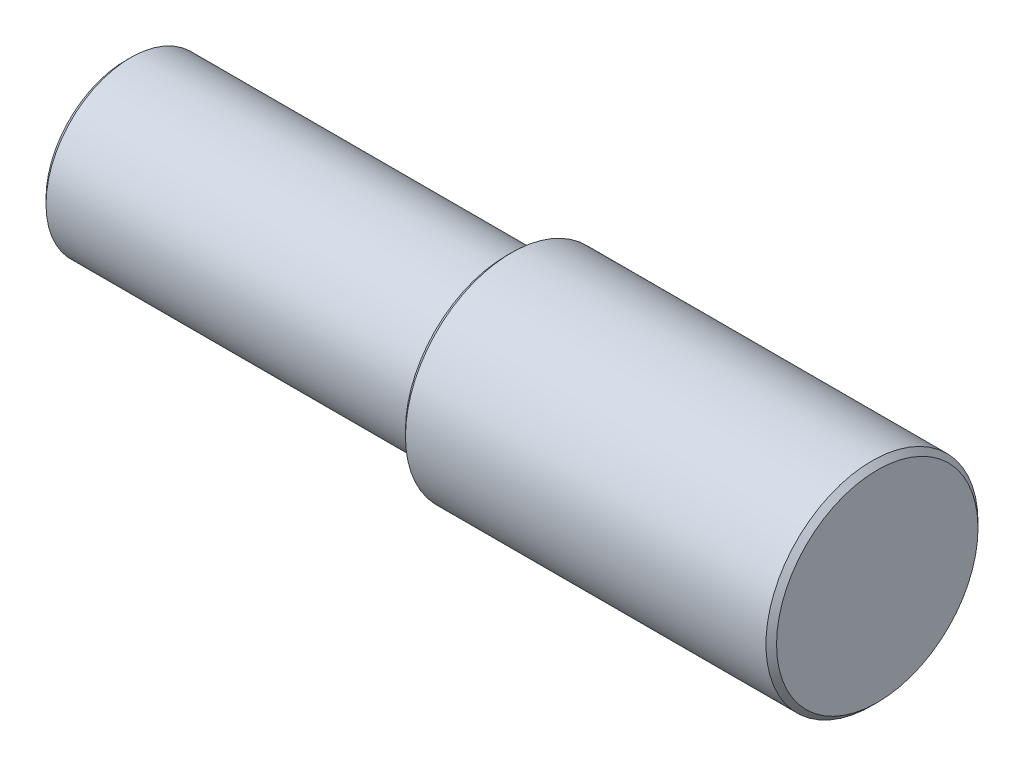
ISO-10303-21;
HEADER;
FILE_DESCRIPTION(('STEP AP214'),'2;1');
FILE_NAME('part.step','',(''),(''),'','','');
FILE_SCHEMA(('AUTOMOTIVE_DESIGN { 1 0 10303 214 1 1 1 1 }'));
ENDSEC;
DATA;
#1=APPLICATION_CONTEXT('core data for automotive mechanical design processes');
#2=APPLICATION_PROTOCOL_DEFINITION('international standard','automotive_design',2000,#1);
#3=PRODUCT_CONTEXT('',#1,'mechanical');
#4=PRODUCT('Part','Part','',(#3));
#5=PRODUCT_RELATED_PRODUCT_CATEGORY('part','',(#4));
#6=PRODUCT_DEFINITION_FORMATION('','',#4);
#7=PRODUCT_DEFINITION_CONTEXT('part definition',#1,'design');
#8=PRODUCT_DEFINITION('design','',#6,#7);
#9=PRODUCT_DEFINITION_SHAPE('','',#8);
#10=(LENGTH_UNIT() NAMED_UNIT(*) SI_UNIT(.MILLI.,.METRE.));
#11=(NAMED_UNIT(*) PLANE_ANGLE_UNIT() SI_UNIT($,.RADIAN.));
#12=(NAMED_UNIT(*) SI_UNIT($,.STERADIAN.) SOLID_ANGLE_UNIT());
#13=UNCERTAINTY_MEASURE_WITH_UNIT(LENGTH_MEASURE(1.E-05),#10,'distance_accuracy_value','');
#14=(GEOMETRIC_REPRESENTATION_CONTEXT(3) GLOBAL_UNCERTAINTY_ASSIGNED_CONTEXT((#13)) GLOBAL_UNIT_ASSIGNED_CONTEXT((#10,
#11,#12)) REPRESENTATION_CONTEXT('',''));
#15=CARTESIAN_POINT('',(0.,0.,0.));
#16=DIRECTION('',(0.,0.,1.));
#17=DIRECTION('',(1.,0.,0.));
#18=AXIS2_PLACEMENT_3D('',#15,#16,#17);
#19=CARTESIAN_POINT('',(-35.,0.,0.));
#20=DIRECTION('',(1.,0.,0.));
#21=DIRECTION('',(0.,0.,-1.));
#22=AXIS2_PLACEMENT_3D('',#19,#20,#21);
#23=CYLINDRICAL_SURFACE('',#22,10.);
#24=CARTESIAN_POINT('',(-0.500000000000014,0.,0.));
#25=DIRECTION('',(1.,0.,0.));
#26=DIRECTION('',(0.,0.,-1.));
#27=AXIS2_PLACEMENT_3D('',#24,#25,#26);
#28=CIRCLE('',#27,10.);
#29=CARTESIAN_POINT('',(-0.500000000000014,0.,-10.));
#30=VERTEX_POINT('',#29);
#31=EDGE_CURVE('E123',#30,#30,#28,.F.);
#32=ORIENTED_EDGE('',*,*,#31,.T.);
#33=EDGE_LOOP('',(#32));
#34=FACE_BOUND('',#33,.T.);
#35=CARTESIAN_POINT('',(-34.5,0.,0.));
#36=DIRECTION('',(-1.,0.,0.));
#37=DIRECTION('',(0.,0.,1.));
#38=AXIS2_PLACEMENT_3D('',#35,#36,#37);
#39=CIRCLE('',#38,10.);
#40=CARTESIAN_POINT('',(-34.5,0.,10.));
#41=VERTEX_POINT('',#40);
#42=EDGE_CURVE('E120',#41,#41,#39,.F.);
#43=ORIENTED_EDGE('',*,*,#42,.T.);
#44=EDGE_LOOP('',(#43));
#45=FACE_BOUND('',#44,.T.);
#46=ADVANCED_FACE('F35',(#34,#45),#23,.T.);
#47=CARTESIAN_POINT('',(-35.,10.,0.));
#48=DIRECTION('',(-1.,0.,0.));
#49=DIRECTION('',(0.,0.,1.));
#50=AXIS2_PLACEMENT_3D('',#47,#48,#49);
#51=PLANE('',#50);
#52=CARTESIAN_POINT('',(-35.,0.,0.));
#53=DIRECTION('',(-1.,0.,0.));
#54=DIRECTION('',(0.,0.,1.));
#55=AXIS2_PLACEMENT_3D('',#52,#53,#54);
#56=CIRCLE('',#55,9.49999999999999);
#57=CARTESIAN_POINT('',(-35.,0.,9.49999999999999));
#58=VERTEX_POINT('',#57);
#59=EDGE_CURVE('E126',#58,#58,#56,.T.);
#60=ORIENTED_EDGE('',*,*,#59,.T.);
#61=EDGE_LOOP('',(#60));
#62=FACE_BOUND('',#61,.T.);
#63=CARTESIAN_POINT('',(-35.,0.,0.));
#64=DIRECTION('',(-1.,0.,0.));
#65=DIRECTION('',(0.,0.,1.));
#66=AXIS2_PLACEMENT_3D('',#63,#64,#65);
#67=CIRCLE('',#66,7.99999999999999);
#68=CARTESIAN_POINT('',(-35.,0.,7.99999999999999));
#69=VERTEX_POINT('',#68);
#70=EDGE_CURVE('E114',#69,#69,#67,.T.);
#71=ORIENTED_EDGE('',*,*,#70,.F.);
#72=EDGE_LOOP('',(#71));
#73=FACE_BOUND('',#72,.T.);
#74=ADVANCED_FACE('F182',(#62,#73),#51,.T.);
#75=CARTESIAN_POINT('',(0.,0.,0.));
#76=DIRECTION('',(1.,0.,0.));
#77=DIRECTION('',(0.,0.,-1.));
#78=AXIS2_PLACEMENT_3D('',#75,#76,#77);
#79=PLANE('',#78);
#80=CARTESIAN_POINT('',(0.,0.,0.));
#81=DIRECTION('',(1.,0.,0.));
#82=DIRECTION('',(0.,0.,-1.));
#83=AXIS2_PLACEMENT_3D('',#80,#81,#82);
#84=CIRCLE('',#83,9.49999999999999);
#85=CARTESIAN_POINT('',(0.,0.,-9.49999999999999));
#86=VERTEX_POINT('',#85);
#87=EDGE_CURVE('E117',#86,#86,#84,.T.);
#88=ORIENTED_EDGE('',*,*,#87,.T.);
#89=EDGE_LOOP('',(#88));
#90=FACE_BOUND('',#89,.T.);
#91=ADVANCED_FACE('F178',(#90),#79,.T.);
#92=CARTESIAN_POINT('',(-70.9,0.,0.));
#93=DIRECTION('',(1.,0.,0.));
#94=DIRECTION('',(0.,0.,-1.));
#95=AXIS2_PLACEMENT_3D('',#92,#93,#94);
#96=CYLINDRICAL_SURFACE('',#95,7.99999999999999);
#97=DIRECTION('',(1.,0.,0.));
#98=VECTOR('',#97,1.);
#99=CARTESIAN_POINT('',(-70.9,-2.5,-7.59934207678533));
#100=LINE('',#99,#98);
#101=CARTESIAN_POINT('',(-65.45,-2.5,-7.59934207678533));
#102=VERTEX_POINT('',#101);
#103=CARTESIAN_POINT('',(-40.45,-2.5,-7.59934207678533));
#104=VERTEX_POINT('',#103);
#105=EDGE_CURVE('E49',#102,#104,#100,.T.);
#106=ORIENTED_EDGE('',*,*,#105,.T.);
#107=CARTESIAN_POINT('',(-40.45,-2.5,-7.59934207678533));
#108=CARTESIAN_POINT('',(-40.3815339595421,-2.5000087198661,-7.59933203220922));
#109=CARTESIAN_POINT('',(-40.3130736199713,-2.4971876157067,-7.60026710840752));
#110=CARTESIAN_POINT('',(-40.1766785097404,-2.48595363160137,-7.60395280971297));
#111=CARTESIAN_POINT('',(-40.1087436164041,-2.47754209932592,-7.60670299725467));
#112=CARTESIAN_POINT('',(-39.9740610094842,-2.45522504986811,-7.61393458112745));
#113=CARTESIAN_POINT('',(-39.9073105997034,-2.44133433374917,-7.61841131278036));
#114=CARTESIAN_POINT('',(-39.7752980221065,-2.40819742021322,-7.6289504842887));
#115=CARTESIAN_POINT('',(-39.7100358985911,-2.38895106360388,-7.63501297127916));
#116=CARTESIAN_POINT('',(-39.5172122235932,-2.32342181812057,-7.65531370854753));
#117=CARTESIAN_POINT('',(-39.3924319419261,-2.26931834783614,-7.67167572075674));
#118=CARTESIAN_POINT('',(-39.1537124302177,-2.1419585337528,-7.70820192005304));
#119=CARTESIAN_POINT('',(-39.0397788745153,-2.06869223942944,-7.72836808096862));
#120=CARTESIAN_POINT('',(-38.8220500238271,-1.90239488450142,-7.77100200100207));
#121=CARTESIAN_POINT('',(-38.7186777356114,-1.80882220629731,-7.79352168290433));
#122=CARTESIAN_POINT('',(-38.5288091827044,-1.60572727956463,-7.83788426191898));
#123=CARTESIAN_POINT('',(-38.4423158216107,-1.49620229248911,-7.85972704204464));
#124=CARTESIAN_POINT('',(-38.2867767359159,-1.26124953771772,-7.90087147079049));
#125=CARTESIAN_POINT('',(-38.2181699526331,-1.13551807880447,-7.92010445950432));
#126=CARTESIAN_POINT('',(-38.1032459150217,-0.873602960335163,-7.95325160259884));
#127=CARTESIAN_POINT('',(-38.056922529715,-0.737422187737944,-7.96716721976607));
#128=CARTESIAN_POINT('',(-37.9892981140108,-0.462930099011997,-7.98774341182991));
#129=CARTESIAN_POINT('',(-37.9672689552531,-0.324814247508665,-7.99461464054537));
#130=CARTESIAN_POINT('',(-37.9465512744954,-0.0466844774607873,-8.00107192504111));
#131=CARTESIAN_POINT('',(-37.9478579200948,0.0933290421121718,-8.00065948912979));
#132=CARTESIAN_POINT('',(-37.9732966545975,0.366149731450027,-7.99274230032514));
#133=CARTESIAN_POINT('',(-37.9966390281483,0.49903879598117,-7.98548293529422));
#134=CARTESIAN_POINT('',(-38.0641904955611,0.758907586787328,-7.96498949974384));
#135=CARTESIAN_POINT('',(-38.1084007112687,0.885886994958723,-7.95175510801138));
#136=CARTESIAN_POINT('',(-38.2169406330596,1.13215685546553,-7.9204691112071));
#137=CARTESIAN_POINT('',(-38.28151017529,1.2513340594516,-7.90236047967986));
#138=CARTESIAN_POINT('',(-38.428743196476,1.47740616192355,-7.8632342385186));
#139=CARTESIAN_POINT('',(-38.5114110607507,1.58429807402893,-7.8422159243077));
#140=CARTESIAN_POINT('',(-38.6965381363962,1.78746586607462,-7.79847545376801));
#141=CARTESIAN_POINT('',(-38.7996774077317,1.88311543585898,-7.77571879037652));
#142=CARTESIAN_POINT('',(-39.0207703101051,2.05596538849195,-7.73181622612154));
#143=CARTESIAN_POINT('',(-39.1387283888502,2.13316021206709,-7.71067081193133));
#144=CARTESIAN_POINT('',(-39.3879029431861,2.26764925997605,-7.67220528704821));
#145=CARTESIAN_POINT('',(-39.5192583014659,2.32470027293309,-7.65493278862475));
#146=CARTESIAN_POINT('',(-39.7903118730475,2.4156091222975,-7.62673815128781));
#147=CARTESIAN_POINT('',(-39.9299968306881,2.44950279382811,-7.61580620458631));
#148=CARTESIAN_POINT('',(-40.1341751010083,2.48078343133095,-7.60564225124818));
#149=CARTESIAN_POINT('',(-40.1971449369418,2.48798807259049,-7.60328541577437));
#150=CARTESIAN_POINT('',(-40.3233989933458,2.49759244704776,-7.60013482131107));
#151=CARTESIAN_POINT('',(-40.3866826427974,2.49999896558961,-7.59933885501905));
#152=CARTESIAN_POINT('',(-40.45,2.50000000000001,-7.59934207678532));
#153=B_SPLINE_CURVE_WITH_KNOTS('',3,(#107,#108,#109,#110,#111,#112,#113,#114,#115,#116,#117,
#118,#119,#120,#121,#122,#123,#124,#125,#126,#127,#128,#129,#130,#131,#132,#133,#134,#135,#136,
#137,#138,#139,#140,#141,#142,#143,#144,#145,#146,#147,#148,#149,#150,#151,#152),.UNSPECIFIED.,
.F.,.F.,(4,2,2,2,2,2,2,2,2,2,2,2,2,2,2,2,2,2,2,2,2,2,4),(0.,0.205323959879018,0.410598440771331,
0.615322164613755,0.820051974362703,1.22896577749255,1.63809233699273,2.05988351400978,
2.48174718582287,2.91315381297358,3.34444167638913,3.76241894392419,4.18030965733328,
4.58377069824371,4.98725343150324,5.39567896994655,5.80420358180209,6.22971654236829,
6.6553575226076,7.08597472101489,7.51592403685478,7.70602799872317,7.89586293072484),.UNSPECIFIED.);
#154=CARTESIAN_POINT('',(-40.45,2.50000000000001,-7.59934207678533));
#155=VERTEX_POINT('',#154);
#156=EDGE_CURVE('E11',#104,#155,#153,.T.);
#157=ORIENTED_EDGE('',*,*,#156,.T.);
#158=DIRECTION('',(1.,0.,0.));
#159=VECTOR('',#158,1.);
#160=CARTESIAN_POINT('',(-70.9,2.5,-7.59934207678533));
#161=LINE('',#160,#159);
#162=CARTESIAN_POINT('',(-65.45,2.5,-7.59934207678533));
#163=VERTEX_POINT('',#162);
#164=EDGE_CURVE('E85',#155,#163,#161,.F.);
#165=ORIENTED_EDGE('',*,*,#164,.T.);
#166=CARTESIAN_POINT('',(-65.45,2.5,-7.59934207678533));
#167=CARTESIAN_POINT('',(-65.518466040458,2.50000871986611,-7.59933203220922));
#168=CARTESIAN_POINT('',(-65.5869263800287,2.4971876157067,-7.60026710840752));
#169=CARTESIAN_POINT('',(-65.7233214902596,2.48595363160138,-7.60395280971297));
#170=CARTESIAN_POINT('',(-65.7912563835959,2.47754209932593,-7.60670299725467));
#171=CARTESIAN_POINT('',(-65.9259389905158,2.45522504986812,-7.61393458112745));
#172=CARTESIAN_POINT('',(-65.9926894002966,2.44133433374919,-7.61841131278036));
#173=CARTESIAN_POINT('',(-66.1247019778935,2.40819742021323,-7.62895048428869));
#174=CARTESIAN_POINT('',(-66.1899641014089,2.38895106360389,-7.63501297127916));
#175=CARTESIAN_POINT('',(-66.3827877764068,2.32342181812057,-7.65531370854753));
#176=CARTESIAN_POINT('',(-66.5075680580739,2.26931834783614,-7.67167572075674));
#177=CARTESIAN_POINT('',(-66.7462875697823,2.1419585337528,-7.70820192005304));
#178=CARTESIAN_POINT('',(-66.8602211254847,2.06869223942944,-7.72836808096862));
#179=CARTESIAN_POINT('',(-67.077949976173,1.90239488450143,-7.77100200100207));
#180=CARTESIAN_POINT('',(-67.1813222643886,1.80882220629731,-7.79352168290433));
#181=CARTESIAN_POINT('',(-67.3711908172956,1.60572727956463,-7.83788426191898));
#182=CARTESIAN_POINT('',(-67.4576841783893,1.49620229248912,-7.85972704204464));
#183=CARTESIAN_POINT('',(-67.6132232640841,1.26124953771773,-7.90087147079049));
#184=CARTESIAN_POINT('',(-67.6818300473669,1.13551807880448,-7.92010445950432));
#185=CARTESIAN_POINT('',(-67.7967540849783,0.873602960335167,-7.95325160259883));
#186=CARTESIAN_POINT('',(-67.843077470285,0.737422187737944,-7.96716721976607));
#187=CARTESIAN_POINT('',(-67.9107018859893,0.462930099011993,-7.98774341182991));
#188=CARTESIAN_POINT('',(-67.9327310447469,0.324814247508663,-7.99461464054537));
#189=CARTESIAN_POINT('',(-67.9534487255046,0.0466844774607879,-8.00107192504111));
#190=CARTESIAN_POINT('',(-67.9521420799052,-0.0933290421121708,-8.00065948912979));
#191=CARTESIAN_POINT('',(-67.9267033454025,-0.366149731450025,-7.99274230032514));
#192=CARTESIAN_POINT('',(-67.9033609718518,-0.499038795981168,-7.98548293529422));
#193=CARTESIAN_POINT('',(-67.8358095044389,-0.758907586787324,-7.96498949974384));
#194=CARTESIAN_POINT('',(-67.7915992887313,-0.885886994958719,-7.95175510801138));
#195=CARTESIAN_POINT('',(-67.6830593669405,-1.13215685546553,-7.9204691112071));
#196=CARTESIAN_POINT('',(-67.61848982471,-1.2513340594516,-7.90236047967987));
#197=CARTESIAN_POINT('',(-67.471256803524,-1.47740616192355,-7.8632342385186));
#198=CARTESIAN_POINT('',(-67.3885889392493,-1.58429807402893,-7.8422159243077));
#199=CARTESIAN_POINT('',(-67.2034618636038,-1.78746586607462,-7.79847545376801));
#200=CARTESIAN_POINT('',(-67.1003225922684,-1.88311543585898,-7.77571879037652));
#201=CARTESIAN_POINT('',(-66.8792296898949,-2.05596538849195,-7.73181622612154));
#202=CARTESIAN_POINT('',(-66.7612716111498,-2.13316021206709,-7.71067081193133));
#203=CARTESIAN_POINT('',(-66.5120970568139,-2.26764925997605,-7.67220528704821));
#204=CARTESIAN_POINT('',(-66.3807416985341,-2.32470027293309,-7.65493278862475));
#205=CARTESIAN_POINT('',(-66.1096881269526,-2.41560912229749,-7.62673815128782));
#206=CARTESIAN_POINT('',(-65.9700031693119,-2.44950279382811,-7.61580620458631));
#207=CARTESIAN_POINT('',(-65.7658248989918,-2.48078343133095,-7.60564225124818));
#208=CARTESIAN_POINT('',(-65.7028550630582,-2.48798807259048,-7.60328541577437));
#209=CARTESIAN_POINT('',(-65.5766010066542,-2.49759244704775,-7.60013482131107));
#210=CARTESIAN_POINT('',(-65.5133173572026,-2.4999989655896,-7.59933885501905));
#211=CARTESIAN_POINT('',(-65.45,-2.5,-7.59934207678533));
#212=B_SPLINE_CURVE_WITH_KNOTS('',3,(#166,#167,#168,#169,#170,#171,#172,#173,#174,#175,#176,
#177,#178,#179,#180,#181,#182,#183,#184,#185,#186,#187,#188,#189,#190,#191,#192,#193,#194,#195,
#196,#197,#198,#199,#200,#201,#202,#203,#204,#205,#206,#207,#208,#209,#210,#211),.UNSPECIFIED.,
.F.,.F.,(4,2,2,2,2,2,2,2,2,2,2,2,2,2,2,2,2,2,2,2,2,2,4),(0.,0.205323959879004,0.410598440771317,
0.615322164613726,0.820051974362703,1.22896577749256,1.63809233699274,2.05988351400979,
2.48174718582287,2.91315381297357,3.34444167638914,3.7624189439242,4.18030965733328,
4.58377069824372,4.98725343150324,5.39567896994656,5.80420358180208,6.2297165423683,
6.65535752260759,7.08597472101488,7.51592403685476,7.70602799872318,7.89586293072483),.UNSPECIFIED.);
#213=EDGE_CURVE('E142',#163,#102,#212,.T.);
#214=ORIENTED_EDGE('',*,*,#213,.T.);
#215=EDGE_LOOP('',(#106,#157,#165,#214));
#216=FACE_BOUND('',#215,.T.);
#217=CARTESIAN_POINT('',(-70.4,0.,0.));
#218=DIRECTION('',(-1.,0.,0.));
#219=DIRECTION('',(0.,0.,1.));
#220=AXIS2_PLACEMENT_3D('',#217,#218,#219);
#221=CIRCLE('',#220,7.99999999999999);
#222=CARTESIAN_POINT('',(-70.4,0.,7.99999999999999));
#223=VERTEX_POINT('',#222);
#224=EDGE_CURVE('E138',#223,#223,#221,.F.);
#225=ORIENTED_EDGE('',*,*,#224,.T.);
#226=EDGE_LOOP('',(#225));
#227=FACE_BOUND('',#226,.T.);
#228=ORIENTED_EDGE('',*,*,#70,.T.);
#229=EDGE_LOOP('',(#228));
#230=FACE_BOUND('',#229,.T.);
#231=ADVANCED_FACE('F149',(#216,#227,#230),#96,.T.);
#232=CARTESIAN_POINT('',(-70.9,0.,0.));
#233=DIRECTION('',(-1.,0.,0.));
#234=DIRECTION('',(0.,0.,1.));
#235=AXIS2_PLACEMENT_3D('',#232,#233,#234);
#236=PLANE('',#235);
#237=CARTESIAN_POINT('',(-70.9,0.,0.));
#238=DIRECTION('',(-1.,0.,0.));
#239=DIRECTION('',(0.,0.,1.));
#240=AXIS2_PLACEMENT_3D('',#237,#238,#239);
#241=CIRCLE('',#240,3.);
#242=CARTESIAN_POINT('',(-70.9,0.,3.));
#243=VERTEX_POINT('',#242);
#244=EDGE_CURVE('E135',#243,#243,#241,.F.);
#245=ORIENTED_EDGE('',*,*,#244,.T.);
#246=EDGE_LOOP('',(#245));
#247=FACE_BOUND('',#246,.T.);
#248=CARTESIAN_POINT('',(-70.9,0.,0.));
#249=DIRECTION('',(-1.,0.,0.));
#250=DIRECTION('',(0.,0.,1.));
#251=AXIS2_PLACEMENT_3D('',#248,#249,#250);
#252=CIRCLE('',#251,7.49999999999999);
#253=CARTESIAN_POINT('',(-70.9,0.,7.49999999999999));
#254=VERTEX_POINT('',#253);
#255=EDGE_CURVE('E132',#254,#254,#252,.T.);
#256=ORIENTED_EDGE('',*,*,#255,.T.);
#257=EDGE_LOOP('',(#256));
#258=FACE_BOUND('',#257,.T.);
#259=ADVANCED_FACE('F172',(#247,#258),#236,.T.);
#260=CARTESIAN_POINT('',(-44.9,0.,0.));
#261=DIRECTION('',(-1.,0.,0.));
#262=DIRECTION('',(0.,0.,1.));
#263=AXIS2_PLACEMENT_3D('',#260,#261,#262);
#264=CONICAL_SURFACE('',#263,2.49999999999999,1.02974425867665);
#265=CARTESIAN_POINT('',(-43.3978484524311,0.,0.));
#266=VERTEX_POINT('',#265);
#267=VERTEX_LOOP('',#266);
#268=FACE_BOUND('',#267,.T.);
#269=CARTESIAN_POINT('',(-44.9,0.,0.));
#270=DIRECTION('',(-1.,0.,0.));
#271=DIRECTION('',(0.,0.,1.));
#272=AXIS2_PLACEMENT_3D('',#269,#270,#271);
#273=CIRCLE('',#272,2.49999999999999);
#274=CARTESIAN_POINT('',(-44.9,0.,2.49999999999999));
#275=VERTEX_POINT('',#274);
#276=EDGE_CURVE('E108',#275,#275,#273,.T.);
#277=ORIENTED_EDGE('',*,*,#276,.T.);
#278=EDGE_LOOP('',(#277));
#279=FACE_BOUND('',#278,.T.);
#280=ADVANCED_FACE('F169',(#268,#279),#264,.F.);
#281=CARTESIAN_POINT('',(-70.9,0.,0.));
#282=DIRECTION('',(-1.,0.,0.));
#283=DIRECTION('',(0.,0.,1.));
#284=AXIS2_PLACEMENT_3D('',#281,#282,#283);
#285=CYLINDRICAL_SURFACE('',#284,2.5);
#286=CARTESIAN_POINT('',(-70.4,0.,0.));
#287=DIRECTION('',(-1.,0.,0.));
#288=DIRECTION('',(0.,0.,1.));
#289=AXIS2_PLACEMENT_3D('',#286,#287,#288);
#290=CIRCLE('',#289,2.5);
#291=CARTESIAN_POINT('',(-70.4,0.,2.5));
#292=VERTEX_POINT('',#291);
#293=EDGE_CURVE('E129',#292,#292,#290,.T.);
#294=ORIENTED_EDGE('',*,*,#293,.T.);
#295=EDGE_LOOP('',(#294));
#296=FACE_BOUND('',#295,.T.);
#297=ORIENTED_EDGE('',*,*,#276,.F.);
#298=EDGE_LOOP('',(#297));
#299=FACE_BOUND('',#298,.T.);
#300=ADVANCED_FACE('F165',(#296,#299),#285,.F.);
#301=CARTESIAN_POINT('',(0.,0.,0.));
#302=DIRECTION('',(-1.,0.,0.));
#303=DIRECTION('',(0.,0.,1.));
#304=AXIS2_PLACEMENT_3D('',#301,#302,#303);
#305=CONICAL_SURFACE('',#304,9.49999999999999,0.78539816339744);
#306=ORIENTED_EDGE('',*,*,#31,.F.);
#307=EDGE_LOOP('',(#306));
#308=FACE_BOUND('',#307,.T.);
#309=ORIENTED_EDGE('',*,*,#87,.F.);
#310=EDGE_LOOP('',(#309));
#311=FACE_BOUND('',#310,.T.);
#312=ADVANCED_FACE('F168',(#308,#311),#305,.T.);
#313=CARTESIAN_POINT('',(-34.5,0.,0.));
#314=DIRECTION('',(1.,0.,0.));
#315=DIRECTION('',(0.,0.,-1.));
#316=AXIS2_PLACEMENT_3D('',#313,#314,#315);
#317=CONICAL_SURFACE('',#316,10.,0.78539816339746);
#318=ORIENTED_EDGE('',*,*,#59,.F.);
#319=EDGE_LOOP('',(#318));
#320=FACE_BOUND('',#319,.T.);
#321=ORIENTED_EDGE('',*,*,#42,.F.);
#322=EDGE_LOOP('',(#321));
#323=FACE_BOUND('',#322,.T.);
#324=ADVANCED_FACE('F194',(#320,#323),#317,.T.);
#325=CARTESIAN_POINT('',(-70.4,0.,0.));
#326=DIRECTION('',(-1.,0.,0.));
#327=DIRECTION('',(0.,0.,1.));
#328=AXIS2_PLACEMENT_3D('',#325,#326,#327);
#329=CONICAL_SURFACE('',#328,2.5,0.785398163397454);
#330=ORIENTED_EDGE('',*,*,#244,.F.);
#331=EDGE_LOOP('',(#330));
#332=FACE_BOUND('',#331,.T.);
#333=ORIENTED_EDGE('',*,*,#293,.F.);
#334=EDGE_LOOP('',(#333));
#335=FACE_BOUND('',#334,.T.);
#336=ADVANCED_FACE('F197',(#332,#335),#329,.F.);
#337=CARTESIAN_POINT('',(-70.9,0.,0.));
#338=DIRECTION('',(1.,0.,0.));
#339=DIRECTION('',(0.,0.,-1.));
#340=AXIS2_PLACEMENT_3D('',#337,#338,#339);
#341=CONICAL_SURFACE('',#340,7.49999999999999,0.785398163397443);
#342=ORIENTED_EDGE('',*,*,#224,.F.);
#343=EDGE_LOOP('',(#342));
#344=FACE_BOUND('',#343,.T.);
#345=ORIENTED_EDGE('',*,*,#255,.F.);
#346=EDGE_LOOP('',(#345));
#347=FACE_BOUND('',#346,.T.);
#348=ADVANCED_FACE('F37',(#344,#347),#341,.T.);
#349=CARTESIAN_POINT('',(-40.45,0.,-15.));
#350=DIRECTION('',(0.,0.,1.));
#351=DIRECTION('',(1.,0.,0.));
#352=AXIS2_PLACEMENT_3D('',#349,#350,#351);
#353=CYLINDRICAL_SURFACE('',#352,2.5);
#354=DIRECTION('',(0.,0.,1.));
#355=VECTOR('',#354,1.);
#356=CARTESIAN_POINT('',(-40.45,-2.5,-15.));
#357=LINE('',#356,#355);
#358=CARTESIAN_POINT('',(-40.45,-2.5,-5.));
#359=VERTEX_POINT('',#358);
#360=EDGE_CURVE('E102',#104,#359,#357,.T.);
#361=ORIENTED_EDGE('',*,*,#360,.T.);
#362=CARTESIAN_POINT('',(-40.45,0.,-5.));
#363=DIRECTION('',(0.,0.,1.));
#364=DIRECTION('',(1.,0.,0.));
#365=AXIS2_PLACEMENT_3D('',#362,#363,#364);
#366=CIRCLE('',#365,2.5);
#367=CARTESIAN_POINT('',(-40.45,2.50000000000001,-5.));
#368=VERTEX_POINT('',#367);
#369=EDGE_CURVE('E95',#359,#368,#366,.T.);
#370=ORIENTED_EDGE('',*,*,#369,.T.);
#371=DIRECTION('',(0.,0.,1.));
#372=VECTOR('',#371,1.);
#373=CARTESIAN_POINT('',(-40.45,2.50000000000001,-15.));
#374=LINE('',#373,#372);
#375=EDGE_CURVE('E80',#155,#368,#374,.T.);
#376=ORIENTED_EDGE('',*,*,#375,.F.);
#377=ORIENTED_EDGE('',*,*,#156,.F.);
#378=EDGE_LOOP('',(#361,#370,#376,#377));
#379=FACE_BOUND('',#378,.T.);
#380=ADVANCED_FACE('F100',(#379),#353,.F.);
#381=CARTESIAN_POINT('',(-65.45,-2.5,-15.));
#382=DIRECTION('',(0.,-1.,0.));
#383=DIRECTION('',(1.,0.,0.));
#384=AXIS2_PLACEMENT_3D('',#381,#382,#383);
#385=PLANE('',#384);
#386=DIRECTION('',(0.,0.,1.));
#387=VECTOR('',#386,1.);
#388=CARTESIAN_POINT('',(-65.45,-2.5,-15.));
#389=LINE('',#388,#387);
#390=CARTESIAN_POINT('',(-65.45,-2.5,-5.));
#391=VERTEX_POINT('',#390);
#392=EDGE_CURVE('E109',#102,#391,#389,.T.);
#393=ORIENTED_EDGE('',*,*,#392,.T.);
#394=DIRECTION('',(1.,0.,0.));
#395=VECTOR('',#394,1.);
#396=CARTESIAN_POINT('',(-65.45,-2.5,-5.));
#397=LINE('',#396,#395);
#398=EDGE_CURVE('E88',#391,#359,#397,.T.);
#399=ORIENTED_EDGE('',*,*,#398,.T.);
#400=ORIENTED_EDGE('',*,*,#360,.F.);
#401=ORIENTED_EDGE('',*,*,#105,.F.);
#402=EDGE_LOOP('',(#393,#399,#400,#401));
#403=FACE_BOUND('',#402,.T.);
#404=ADVANCED_FACE('F158',(#403),#385,.F.);
#405=CARTESIAN_POINT('',(-65.45,0.,-15.));
#406=DIRECTION('',(0.,0.,1.));
#407=DIRECTION('',(1.,0.,0.));
#408=AXIS2_PLACEMENT_3D('',#405,#406,#407);
#409=CYLINDRICAL_SURFACE('',#408,2.5);
#410=DIRECTION('',(0.,0.,1.));
#411=VECTOR('',#410,1.);
#412=CARTESIAN_POINT('',(-65.45,2.5,-15.));
#413=LINE('',#412,#411);
#414=CARTESIAN_POINT('',(-65.45,2.5,-5.));
#415=VERTEX_POINT('',#414);
#416=EDGE_CURVE('E56',#163,#415,#413,.T.);
#417=ORIENTED_EDGE('',*,*,#416,.T.);
#418=CARTESIAN_POINT('',(-65.45,0.,-5.));
#419=DIRECTION('',(0.,0.,1.));
#420=DIRECTION('',(1.,0.,0.));
#421=AXIS2_PLACEMENT_3D('',#418,#419,#420);
#422=CIRCLE('',#421,2.5);
#423=EDGE_CURVE('E98',#415,#391,#422,.T.);
#424=ORIENTED_EDGE('',*,*,#423,.T.);
#425=ORIENTED_EDGE('',*,*,#392,.F.);
#426=ORIENTED_EDGE('',*,*,#213,.F.);
#427=EDGE_LOOP('',(#417,#424,#425,#426));
#428=FACE_BOUND('',#427,.T.);
#429=ADVANCED_FACE('F153',(#428),#409,.F.);
#430=CARTESIAN_POINT('',(-40.45,2.50000000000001,-15.));
#431=DIRECTION('',(0.,1.,0.));
#432=DIRECTION('',(-1.,0.,0.));
#433=AXIS2_PLACEMENT_3D('',#430,#431,#432);
#434=PLANE('',#433);
#435=ORIENTED_EDGE('',*,*,#375,.T.);
#436=DIRECTION('',(-1.,0.,0.));
#437=VECTOR('',#436,1.);
#438=CARTESIAN_POINT('',(-40.45,2.50000000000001,-5.));
#439=LINE('',#438,#437);
#440=EDGE_CURVE('E83',#368,#415,#439,.T.);
#441=ORIENTED_EDGE('',*,*,#440,.T.);
#442=ORIENTED_EDGE('',*,*,#416,.F.);
#443=ORIENTED_EDGE('',*,*,#164,.F.);
#444=EDGE_LOOP('',(#435,#441,#442,#443));
#445=FACE_BOUND('',#444,.T.);
#446=ADVANCED_FACE('F82',(#445),#434,.F.);
#447=CARTESIAN_POINT('',(-40.45,0.,-5.));
#448=DIRECTION('',(0.,0.,1.));
#449=DIRECTION('',(1.,0.,0.));
#450=AXIS2_PLACEMENT_3D('',#447,#448,#449);
#451=PLANE('',#450);
#452=ORIENTED_EDGE('',*,*,#369,.F.);
#453=ORIENTED_EDGE('',*,*,#398,.F.);
#454=ORIENTED_EDGE('',*,*,#423,.F.);
#455=ORIENTED_EDGE('',*,*,#440,.F.);
#456=EDGE_LOOP('',(#452,#453,#454,#455));
#457=FACE_BOUND('',#456,.T.);
#458=ADVANCED_FACE('F93',(#457),#451,.F.);
#459=CLOSED_SHELL('',(#46,#74,#91,#231,#259,#280,#300,#312,#324,#336,#348,#380,#404,#429,#446,#458));
#460=MANIFOLD_SOLID_BREP('B2',#459);
#461=ADVANCED_BREP_SHAPE_REPRESENTATION('',(#18,#460),#14);
#462=SHAPE_DEFINITION_REPRESENTATION(#9,#461);
ENDSEC;
END-ISO-10303-21;
